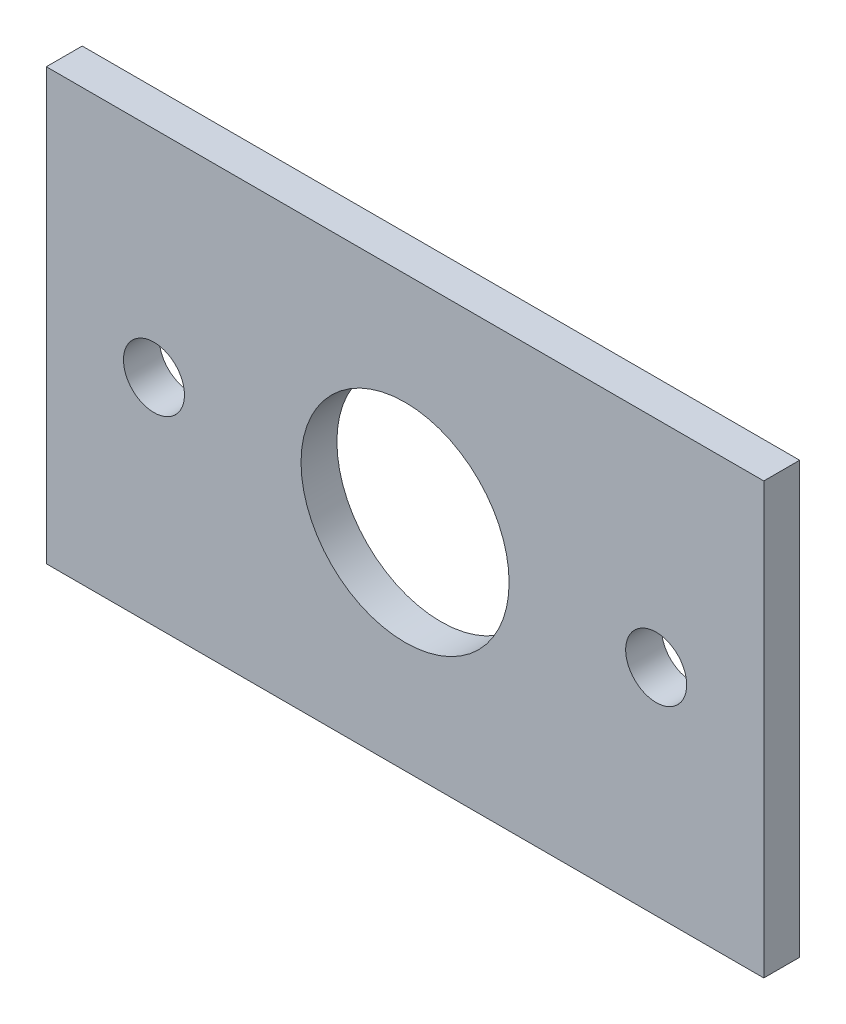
ISO-10303-21;
HEADER;
FILE_DESCRIPTION(('STEP AP214'),'2;1');
FILE_NAME('part.step','',(''),(''),'','','');
FILE_SCHEMA(('AUTOMOTIVE_DESIGN { 1 0 10303 214 1 1 1 1 }'));
ENDSEC;
DATA;
#1=APPLICATION_CONTEXT('core data for automotive mechanical design processes');
#2=APPLICATION_PROTOCOL_DEFINITION('international standard','automotive_design',2000,#1);
#3=PRODUCT_CONTEXT('',#1,'mechanical');
#4=PRODUCT('Part','Part','',(#3));
#5=PRODUCT_RELATED_PRODUCT_CATEGORY('part','',(#4));
#6=PRODUCT_DEFINITION_FORMATION('','',#4);
#7=PRODUCT_DEFINITION_CONTEXT('part definition',#1,'design');
#8=PRODUCT_DEFINITION('design','',#6,#7);
#9=PRODUCT_DEFINITION_SHAPE('','',#8);
#10=(LENGTH_UNIT() NAMED_UNIT(*) SI_UNIT(.MILLI.,.METRE.));
#11=(NAMED_UNIT(*) PLANE_ANGLE_UNIT() SI_UNIT($,.RADIAN.));
#12=(NAMED_UNIT(*) SI_UNIT($,.STERADIAN.) SOLID_ANGLE_UNIT());
#13=UNCERTAINTY_MEASURE_WITH_UNIT(LENGTH_MEASURE(1.E-05),#10,'distance_accuracy_value','');
#14=(GEOMETRIC_REPRESENTATION_CONTEXT(3) GLOBAL_UNCERTAINTY_ASSIGNED_CONTEXT((#13)) GLOBAL_UNIT_ASSIGNED_CONTEXT((#10,
#11,#12)) REPRESENTATION_CONTEXT('',''));
#15=CARTESIAN_POINT('',(0.,0.,0.));
#16=DIRECTION('',(0.,0.,1.));
#17=DIRECTION('',(1.,0.,0.));
#18=AXIS2_PLACEMENT_3D('',#15,#16,#17);
#19=CARTESIAN_POINT('',(0.,0.,2.));
#20=DIRECTION('',(0.,0.,-1.));
#21=DIRECTION('',(-1.,0.,0.));
#22=AXIS2_PLACEMENT_3D('',#19,#20,#21);
#23=PLANE('',#22);
#24=DIRECTION('',(0.,-1.,0.));
#25=VECTOR('',#24,1.);
#26=CARTESIAN_POINT('',(-20.,-12.,2.));
#27=LINE('',#26,#25);
#28=CARTESIAN_POINT('',(-20.,12.,2.));
#29=VERTEX_POINT('',#28);
#30=CARTESIAN_POINT('',(-20.,-12.,2.));
#31=VERTEX_POINT('',#30);
#32=EDGE_CURVE('E93',#29,#31,#27,.T.);
#33=ORIENTED_EDGE('',*,*,#32,.T.);
#34=DIRECTION('',(1.,0.,0.));
#35=VECTOR('',#34,1.);
#36=CARTESIAN_POINT('',(-20.,-12.,2.));
#37=LINE('',#36,#35);
#38=CARTESIAN_POINT('',(20.,-12.,2.));
#39=VERTEX_POINT('',#38);
#40=EDGE_CURVE('E88',#31,#39,#37,.T.);
#41=ORIENTED_EDGE('',*,*,#40,.T.);
#42=DIRECTION('',(0.,1.,0.));
#43=VECTOR('',#42,1.);
#44=CARTESIAN_POINT('',(20.,-12.,2.));
#45=LINE('',#44,#43);
#46=CARTESIAN_POINT('',(20.,12.,2.));
#47=VERTEX_POINT('',#46);
#48=EDGE_CURVE('E90',#39,#47,#45,.T.);
#49=ORIENTED_EDGE('',*,*,#48,.T.);
#50=DIRECTION('',(-1.,0.,0.));
#51=VECTOR('',#50,1.);
#52=CARTESIAN_POINT('',(-20.,12.,2.));
#53=LINE('',#52,#51);
#54=EDGE_CURVE('E57',#47,#29,#53,.T.);
#55=ORIENTED_EDGE('',*,*,#54,.T.);
#56=EDGE_LOOP('',(#33,#41,#49,#55));
#57=FACE_BOUND('',#56,.T.);
#58=CARTESIAN_POINT('',(0.,0.,2.));
#59=DIRECTION('',(0.,0.,1.));
#60=DIRECTION('',(1.,0.,0.));
#61=AXIS2_PLACEMENT_3D('',#58,#59,#60);
#62=CIRCLE('',#61,5.8);
#63=CARTESIAN_POINT('',(5.8,0.,2.));
#64=VERTEX_POINT('',#63);
#65=EDGE_CURVE('E106',#64,#64,#62,.T.);
#66=ORIENTED_EDGE('',*,*,#65,.F.);
#67=EDGE_LOOP('',(#66));
#68=FACE_BOUND('',#67,.T.);
#69=CARTESIAN_POINT('',(-14.,0.,2.));
#70=DIRECTION('',(0.,0.,1.));
#71=DIRECTION('',(1.,0.,0.));
#72=AXIS2_PLACEMENT_3D('',#69,#70,#71);
#73=CIRCLE('',#72,1.7);
#74=CARTESIAN_POINT('',(-12.3,0.,2.));
#75=VERTEX_POINT('',#74);
#76=EDGE_CURVE('E122',#75,#75,#73,.T.);
#77=ORIENTED_EDGE('',*,*,#76,.F.);
#78=EDGE_LOOP('',(#77));
#79=FACE_BOUND('',#78,.T.);
#80=CARTESIAN_POINT('',(14.,0.,2.));
#81=DIRECTION('',(0.,0.,1.));
#82=DIRECTION('',(1.,0.,0.));
#83=AXIS2_PLACEMENT_3D('',#80,#81,#82);
#84=CIRCLE('',#83,1.7);
#85=CARTESIAN_POINT('',(15.7,0.,2.));
#86=VERTEX_POINT('',#85);
#87=EDGE_CURVE('E130',#86,#86,#84,.T.);
#88=ORIENTED_EDGE('',*,*,#87,.F.);
#89=EDGE_LOOP('',(#88));
#90=FACE_BOUND('',#89,.T.);
#91=ADVANCED_FACE('F39',(#57,#68,#79,#90),#23,.F.);
#92=CARTESIAN_POINT('',(0.,0.,0.));
#93=DIRECTION('',(0.,0.,-1.));
#94=DIRECTION('',(-1.,0.,0.));
#95=AXIS2_PLACEMENT_3D('',#92,#93,#94);
#96=PLANE('',#95);
#97=CARTESIAN_POINT('',(-14.,0.,0.));
#98=DIRECTION('',(0.,0.,1.));
#99=DIRECTION('',(1.,0.,0.));
#100=AXIS2_PLACEMENT_3D('',#97,#98,#99);
#101=CIRCLE('',#100,1.7);
#102=CARTESIAN_POINT('',(-12.3,0.,0.));
#103=VERTEX_POINT('',#102);
#104=EDGE_CURVE('E121',#103,#103,#101,.T.);
#105=ORIENTED_EDGE('',*,*,#104,.T.);
#106=EDGE_LOOP('',(#105));
#107=FACE_BOUND('',#106,.T.);
#108=DIRECTION('',(0.,-1.,0.));
#109=VECTOR('',#108,1.);
#110=CARTESIAN_POINT('',(-20.,-12.,0.));
#111=LINE('',#110,#109);
#112=CARTESIAN_POINT('',(-20.,12.,0.));
#113=VERTEX_POINT('',#112);
#114=CARTESIAN_POINT('',(-20.,-12.,0.));
#115=VERTEX_POINT('',#114);
#116=EDGE_CURVE('E103',#113,#115,#111,.T.);
#117=ORIENTED_EDGE('',*,*,#116,.F.);
#118=DIRECTION('',(-1.,0.,0.));
#119=VECTOR('',#118,1.);
#120=CARTESIAN_POINT('',(-20.,12.,0.));
#121=LINE('',#120,#119);
#122=CARTESIAN_POINT('',(20.,12.,0.));
#123=VERTEX_POINT('',#122);
#124=EDGE_CURVE('E78',#123,#113,#121,.T.);
#125=ORIENTED_EDGE('',*,*,#124,.F.);
#126=DIRECTION('',(0.,1.,0.));
#127=VECTOR('',#126,1.);
#128=CARTESIAN_POINT('',(20.,-12.,0.));
#129=LINE('',#128,#127);
#130=CARTESIAN_POINT('',(20.,-12.,0.));
#131=VERTEX_POINT('',#130);
#132=EDGE_CURVE('E71',#131,#123,#129,.T.);
#133=ORIENTED_EDGE('',*,*,#132,.F.);
#134=DIRECTION('',(1.,0.,0.));
#135=VECTOR('',#134,1.);
#136=CARTESIAN_POINT('',(-20.,-12.,0.));
#137=LINE('',#136,#135);
#138=EDGE_CURVE('E92',#115,#131,#137,.T.);
#139=ORIENTED_EDGE('',*,*,#138,.F.);
#140=EDGE_LOOP('',(#117,#125,#133,#139));
#141=FACE_BOUND('',#140,.T.);
#142=CARTESIAN_POINT('',(0.,0.,0.));
#143=DIRECTION('',(0.,0.,1.));
#144=DIRECTION('',(1.,0.,0.));
#145=AXIS2_PLACEMENT_3D('',#142,#143,#144);
#146=CIRCLE('',#145,5.8);
#147=CARTESIAN_POINT('',(5.8,0.,0.));
#148=VERTEX_POINT('',#147);
#149=EDGE_CURVE('E117',#148,#148,#146,.T.);
#150=ORIENTED_EDGE('',*,*,#149,.T.);
#151=EDGE_LOOP('',(#150));
#152=FACE_BOUND('',#151,.T.);
#153=CARTESIAN_POINT('',(14.,0.,0.));
#154=DIRECTION('',(0.,0.,1.));
#155=DIRECTION('',(1.,0.,0.));
#156=AXIS2_PLACEMENT_3D('',#153,#154,#155);
#157=CIRCLE('',#156,1.7);
#158=CARTESIAN_POINT('',(15.7,0.,0.));
#159=VERTEX_POINT('',#158);
#160=EDGE_CURVE('E128',#159,#159,#157,.T.);
#161=ORIENTED_EDGE('',*,*,#160,.T.);
#162=EDGE_LOOP('',(#161));
#163=FACE_BOUND('',#162,.T.);
#164=ADVANCED_FACE('F111',(#107,#141,#152,#163),#96,.T.);
#165=CARTESIAN_POINT('',(-20.,-12.,2.));
#166=DIRECTION('',(1.,0.,0.));
#167=DIRECTION('',(0.,0.,-1.));
#168=AXIS2_PLACEMENT_3D('',#165,#166,#167);
#169=PLANE('',#168);
#170=ORIENTED_EDGE('',*,*,#116,.T.);
#171=DIRECTION('',(0.,0.,-1.));
#172=VECTOR('',#171,1.);
#173=CARTESIAN_POINT('',(-20.,-12.,2.));
#174=LINE('',#173,#172);
#175=EDGE_CURVE('E11',#31,#115,#174,.T.);
#176=ORIENTED_EDGE('',*,*,#175,.F.);
#177=ORIENTED_EDGE('',*,*,#32,.F.);
#178=DIRECTION('',(0.,0.,-1.));
#179=VECTOR('',#178,1.);
#180=CARTESIAN_POINT('',(-20.,12.,2.));
#181=LINE('',#180,#179);
#182=EDGE_CURVE('E97',#29,#113,#181,.T.);
#183=ORIENTED_EDGE('',*,*,#182,.T.);
#184=EDGE_LOOP('',(#170,#176,#177,#183));
#185=FACE_BOUND('',#184,.T.);
#186=ADVANCED_FACE('F41',(#185),#169,.F.);
#187=CARTESIAN_POINT('',(-20.,-12.,2.));
#188=DIRECTION('',(0.,1.,0.));
#189=DIRECTION('',(0.,0.,1.));
#190=AXIS2_PLACEMENT_3D('',#187,#188,#189);
#191=PLANE('',#190);
#192=ORIENTED_EDGE('',*,*,#138,.T.);
#193=DIRECTION('',(0.,0.,-1.));
#194=VECTOR('',#193,1.);
#195=CARTESIAN_POINT('',(20.,-12.,2.));
#196=LINE('',#195,#194);
#197=EDGE_CURVE('E48',#39,#131,#196,.T.);
#198=ORIENTED_EDGE('',*,*,#197,.F.);
#199=ORIENTED_EDGE('',*,*,#40,.F.);
#200=ORIENTED_EDGE('',*,*,#175,.T.);
#201=EDGE_LOOP('',(#192,#198,#199,#200));
#202=FACE_BOUND('',#201,.T.);
#203=ADVANCED_FACE('F94',(#202),#191,.F.);
#204=CARTESIAN_POINT('',(20.,-12.,2.));
#205=DIRECTION('',(-1.,0.,0.));
#206=DIRECTION('',(0.,0.,1.));
#207=AXIS2_PLACEMENT_3D('',#204,#205,#206);
#208=PLANE('',#207);
#209=ORIENTED_EDGE('',*,*,#132,.T.);
#210=DIRECTION('',(0.,0.,-1.));
#211=VECTOR('',#210,1.);
#212=CARTESIAN_POINT('',(20.,12.,2.));
#213=LINE('',#212,#211);
#214=EDGE_CURVE('E96',#47,#123,#213,.T.);
#215=ORIENTED_EDGE('',*,*,#214,.F.);
#216=ORIENTED_EDGE('',*,*,#48,.F.);
#217=ORIENTED_EDGE('',*,*,#197,.T.);
#218=EDGE_LOOP('',(#209,#215,#216,#217));
#219=FACE_BOUND('',#218,.T.);
#220=ADVANCED_FACE('F100',(#219),#208,.F.);
#221=CARTESIAN_POINT('',(-20.,12.,2.));
#222=DIRECTION('',(0.,-1.,0.));
#223=DIRECTION('',(0.,0.,-1.));
#224=AXIS2_PLACEMENT_3D('',#221,#222,#223);
#225=PLANE('',#224);
#226=ORIENTED_EDGE('',*,*,#124,.T.);
#227=ORIENTED_EDGE('',*,*,#182,.F.);
#228=ORIENTED_EDGE('',*,*,#54,.F.);
#229=ORIENTED_EDGE('',*,*,#214,.T.);
#230=EDGE_LOOP('',(#226,#227,#228,#229));
#231=FACE_BOUND('',#230,.T.);
#232=ADVANCED_FACE('F112',(#231),#225,.F.);
#233=CARTESIAN_POINT('',(0.,0.,2.));
#234=DIRECTION('',(0.,0.,-1.));
#235=DIRECTION('',(-1.,0.,0.));
#236=AXIS2_PLACEMENT_3D('',#233,#234,#235);
#237=CYLINDRICAL_SURFACE('',#236,5.8);
#238=ORIENTED_EDGE('',*,*,#65,.T.);
#239=EDGE_LOOP('',(#238));
#240=FACE_BOUND('',#239,.T.);
#241=ORIENTED_EDGE('',*,*,#149,.F.);
#242=EDGE_LOOP('',(#241));
#243=FACE_BOUND('',#242,.T.);
#244=ADVANCED_FACE('F150',(#240,#243),#237,.F.);
#245=CARTESIAN_POINT('',(-14.,0.,2.));
#246=DIRECTION('',(0.,0.,-1.));
#247=DIRECTION('',(-1.,0.,0.));
#248=AXIS2_PLACEMENT_3D('',#245,#246,#247);
#249=CYLINDRICAL_SURFACE('',#248,1.7);
#250=ORIENTED_EDGE('',*,*,#76,.T.);
#251=EDGE_LOOP('',(#250));
#252=FACE_BOUND('',#251,.T.);
#253=ORIENTED_EDGE('',*,*,#104,.F.);
#254=EDGE_LOOP('',(#253));
#255=FACE_BOUND('',#254,.T.);
#256=ADVANCED_FACE('F194',(#252,#255),#249,.F.);
#257=CARTESIAN_POINT('',(14.,0.,2.));
#258=DIRECTION('',(0.,0.,-1.));
#259=DIRECTION('',(-1.,0.,0.));
#260=AXIS2_PLACEMENT_3D('',#257,#258,#259);
#261=CYLINDRICAL_SURFACE('',#260,1.7);
#262=ORIENTED_EDGE('',*,*,#87,.T.);
#263=EDGE_LOOP('',(#262));
#264=FACE_BOUND('',#263,.T.);
#265=ORIENTED_EDGE('',*,*,#160,.F.);
#266=EDGE_LOOP('',(#265));
#267=FACE_BOUND('',#266,.T.);
#268=ADVANCED_FACE('F137',(#264,#267),#261,.F.);
#269=CLOSED_SHELL('',(#91,#164,#186,#203,#220,#232,#244,#256,#268));
#270=MANIFOLD_SOLID_BREP('B2',#269);
#271=ADVANCED_BREP_SHAPE_REPRESENTATION('',(#18,#270),#14);
#272=SHAPE_DEFINITION_REPRESENTATION(#9,#271);
ENDSEC;
END-ISO-10303-21;
